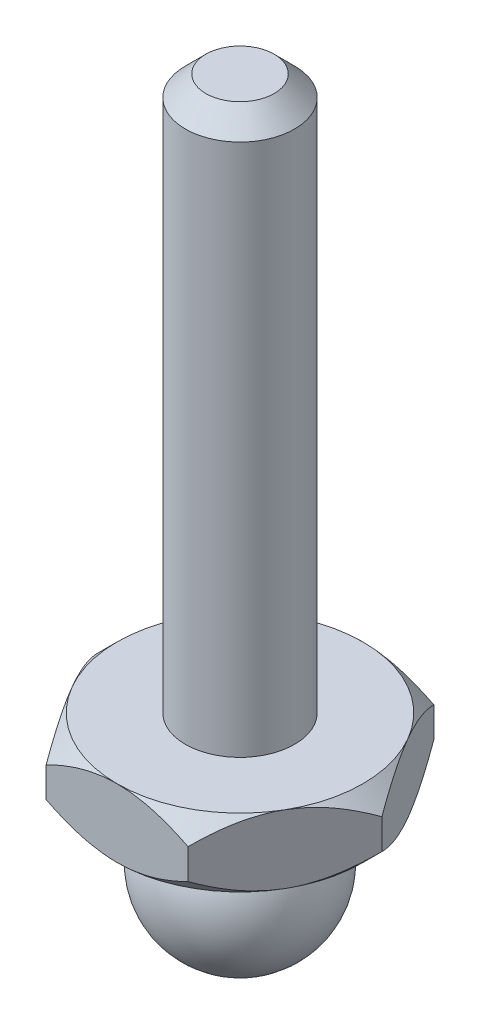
from build123d import *

# Parameters (mm, degrees)
SKETCH1_R           = 4
BOSS_EXTRUDE1_DEPTH = 50
BOSS_EXTRUDE2_DEPTH = 5
CHAMFER1_SIZE       = 1.5


with BuildPart() as part:
    # Sketch1 → Boss-Extrude1 (new body)
    with BuildSketch(Plane(origin=(0, 0, 0), x_dir=(1, 0, 0), z_dir=(0, 1, 0))):
        with Locations(Location((0, 0, 0), (0, 0, 270))):
            Circle(SKETCH1_R)
    extrude(amount=BOSS_EXTRUDE1_DEPTH)

    # Sketch2 → Revolve1 (revolve)
    with BuildSketch(Plane(origin=(0, 0, 0), x_dir=(0, 0, -1), z_dir=(1, 0, 0))):
        with BuildLine():
            Line((0, 6), (0, -6))
            ThreePointArc((0, -6), (-6, 0), (0, 6))
        make_face()
    revolve(axis=Axis((0, 0, 0), (0, -1, 0)))

    # Sketch4 → Boss-Extrude2 (add)
    with BuildSketch(Plane(origin=(0, 4.472135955, 0), x_dir=(-1, 0, 0), z_dir=(0, 1, 0))):
        Polygon((-10.392304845, 0), (-5.196152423, -9), (5.196152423, -9), (10.392304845, 0), (5.196152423, 9), (-5.196152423, 9), align=None)
    extrude(amount=BOSS_EXTRUDE2_DEPTH)

    # Sketch5 → Cut-Revolve1 (revolve, cut)
    with BuildSketch(Plane(origin=(0, 0, 0), x_dir=(0, 0, -1), z_dir=(1, 0, 0)), mode=Mode.PRIVATE) as cut_revolve1_sk:
        Polygon((-9, 9.472135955), (-11, 9.472135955), (-11, 7.472135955), align=None)
        Polygon((-9, 4.472135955), (-11, 4.472135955), (-11, 6.472135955), align=None)
    revolve(cut_revolve1_sk.sketch.rotate(Axis((0, 4.472135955, 0), (0, 1, 0)), 180), axis=Axis((0, 4.472135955, 0), (0, 1, 0)), mode=Mode.SUBTRACT)

    # Chamfer1
    chamfer1_edges = [part.edges().sort_by_distance(p)[0] for p in [
        (0, 50, -4),
    ]]
    chamfer(chamfer1_edges, length=CHAMFER1_SIZE)


solid = part.part
